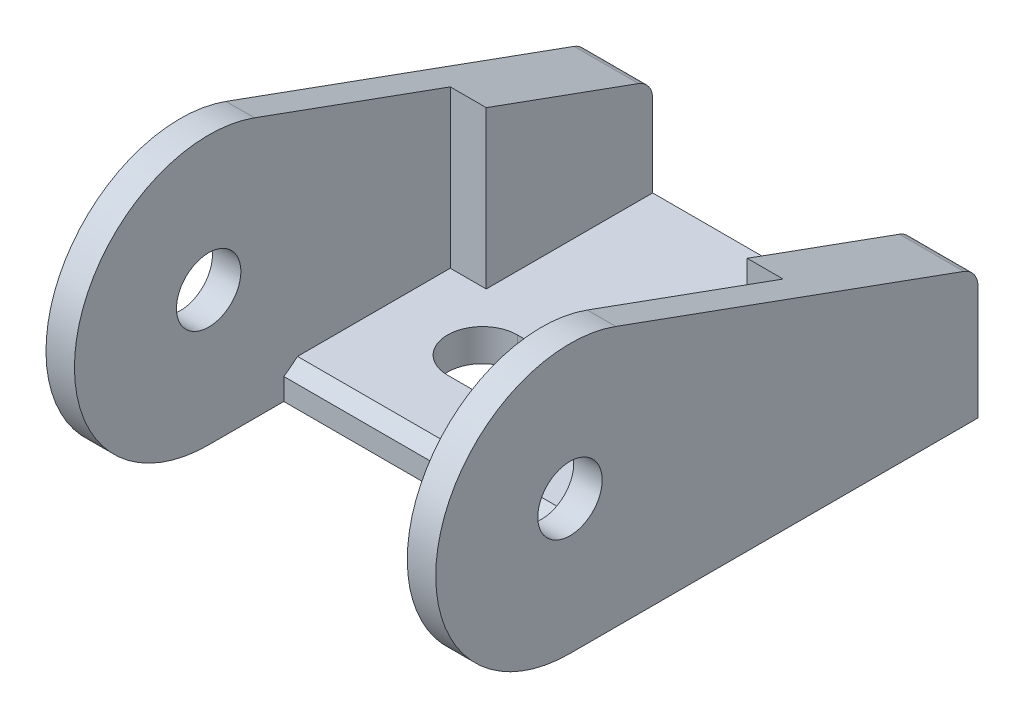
ISO-10303-21;
HEADER;
FILE_DESCRIPTION(('STEP AP214'),'2;1');
FILE_NAME('part.step','',(''),(''),'','','');
FILE_SCHEMA(('AUTOMOTIVE_DESIGN { 1 0 10303 214 1 1 1 1 }'));
ENDSEC;
DATA;
#1=APPLICATION_CONTEXT('core data for automotive mechanical design processes');
#2=APPLICATION_PROTOCOL_DEFINITION('international standard','automotive_design',2000,#1);
#3=PRODUCT_CONTEXT('',#1,'mechanical');
#4=PRODUCT('Part','Part','',(#3));
#5=PRODUCT_RELATED_PRODUCT_CATEGORY('part','',(#4));
#6=PRODUCT_DEFINITION_FORMATION('','',#4);
#7=PRODUCT_DEFINITION_CONTEXT('part definition',#1,'design');
#8=PRODUCT_DEFINITION('design','',#6,#7);
#9=PRODUCT_DEFINITION_SHAPE('','',#8);
#10=(LENGTH_UNIT() NAMED_UNIT(*) SI_UNIT(.MILLI.,.METRE.));
#11=(NAMED_UNIT(*) PLANE_ANGLE_UNIT() SI_UNIT($,.RADIAN.));
#12=(NAMED_UNIT(*) SI_UNIT($,.STERADIAN.) SOLID_ANGLE_UNIT());
#13=UNCERTAINTY_MEASURE_WITH_UNIT(LENGTH_MEASURE(1.E-05),#10,'distance_accuracy_value','');
#14=(GEOMETRIC_REPRESENTATION_CONTEXT(3) GLOBAL_UNCERTAINTY_ASSIGNED_CONTEXT((#13)) GLOBAL_UNIT_ASSIGNED_CONTEXT((#10,
#11,#12)) REPRESENTATION_CONTEXT('',''));
#15=CARTESIAN_POINT('',(0.,0.,0.));
#16=DIRECTION('',(0.,0.,1.));
#17=DIRECTION('',(1.,0.,0.));
#18=AXIS2_PLACEMENT_3D('',#15,#16,#17);
#19=CARTESIAN_POINT('',(12.15,10.5984666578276,-36.));
#20=DIRECTION('',(-1.,0.,0.));
#21=DIRECTION('',(0.,0.,1.));
#22=AXIS2_PLACEMENT_3D('',#19,#20,#21);
#23=CYLINDRICAL_SURFACE('',#22,2.);
#24=CARTESIAN_POINT('',(12.15,10.5984666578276,-36.));
#25=DIRECTION('',(-1.,0.,0.));
#26=DIRECTION('',(0.,0.,1.));
#27=AXIS2_PLACEMENT_3D('',#24,#25,#26);
#28=CIRCLE('',#27,2.);
#29=CARTESIAN_POINT('',(12.15,10.5984666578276,-38.));
#30=VERTEX_POINT('',#29);
#31=CARTESIAN_POINT('',(12.15,12.4783645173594,-36.6826302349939));
#32=VERTEX_POINT('',#31);
#33=EDGE_CURVE('E19',#30,#32,#28,.F.);
#34=ORIENTED_EDGE('',*,*,#33,.T.);
#35=DIRECTION('',(1.,0.,0.));
#36=VECTOR('',#35,1.);
#37=CARTESIAN_POINT('',(12.15,12.4783645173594,-36.6826302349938));
#38=LINE('',#37,#36);
#39=CARTESIAN_POINT('',(18.15,12.4783645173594,-36.6826302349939));
#40=VERTEX_POINT('',#39);
#41=EDGE_CURVE('E210',#40,#32,#38,.F.);
#42=ORIENTED_EDGE('',*,*,#41,.F.);
#43=CARTESIAN_POINT('',(18.15,10.5984666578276,-36.));
#44=DIRECTION('',(-1.,0.,0.));
#45=DIRECTION('',(0.,0.,1.));
#46=AXIS2_PLACEMENT_3D('',#43,#44,#45);
#47=CIRCLE('',#46,2.);
#48=CARTESIAN_POINT('',(18.15,10.5984666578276,-38.));
#49=VERTEX_POINT('',#48);
#50=EDGE_CURVE('E202',#40,#49,#47,.T.);
#51=ORIENTED_EDGE('',*,*,#50,.T.);
#52=DIRECTION('',(1.,0.,0.));
#53=VECTOR('',#52,1.);
#54=CARTESIAN_POINT('',(18.15,10.5984666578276,-38.));
#55=LINE('',#54,#53);
#56=EDGE_CURVE('E195',#49,#30,#55,.F.);
#57=ORIENTED_EDGE('',*,*,#56,.T.);
#58=EDGE_LOOP('',(#34,#42,#51,#57));
#59=FACE_BOUND('',#58,.T.);
#60=ADVANCED_FACE('F16',(#59),#23,.T.);
#61=CARTESIAN_POINT('',(12.15,12.5,0.));
#62=DIRECTION('',(1.,0.,0.));
#63=DIRECTION('',(0.,0.,-1.));
#64=AXIS2_PLACEMENT_3D('',#61,#62,#63);
#65=PLANE('',#64);
#66=DIRECTION('',(0.,0.34131511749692,0.939948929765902));
#67=VECTOR('',#66,1.);
#68=CARTESIAN_POINT('',(12.15,12.4783645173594,-36.6826302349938));
#69=LINE('',#68,#67);
#70=CARTESIAN_POINT('',(12.15,17.6283742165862,-22.5));
#71=VERTEX_POINT('',#70);
#72=EDGE_CURVE('E185',#32,#71,#69,.T.);
#73=ORIENTED_EDGE('',*,*,#72,.F.);
#74=ORIENTED_EDGE('',*,*,#33,.F.);
#75=DIRECTION('',(0.,1.,0.));
#76=VECTOR('',#75,1.);
#77=CARTESIAN_POINT('',(12.15,3.,-38.));
#78=LINE('',#77,#76);
#79=CARTESIAN_POINT('',(12.15,3.,-38.));
#80=VERTEX_POINT('',#79);
#81=EDGE_CURVE('E183',#30,#80,#78,.F.);
#82=ORIENTED_EDGE('',*,*,#81,.T.);
#83=DIRECTION('',(0.,0.,1.));
#84=VECTOR('',#83,1.);
#85=CARTESIAN_POINT('',(12.15,3.,0.));
#86=LINE('',#85,#84);
#87=CARTESIAN_POINT('',(12.15,3.,-22.5));
#88=VERTEX_POINT('',#87);
#89=EDGE_CURVE('E235',#88,#80,#86,.F.);
#90=ORIENTED_EDGE('',*,*,#89,.F.);
#91=DIRECTION('',(0.,1.,0.));
#92=VECTOR('',#91,1.);
#93=CARTESIAN_POINT('',(12.15,3.,-22.5));
#94=LINE('',#93,#92);
#95=EDGE_CURVE('E233',#71,#88,#94,.F.);
#96=ORIENTED_EDGE('',*,*,#95,.F.);
#97=EDGE_LOOP('',(#73,#74,#82,#90,#96));
#98=FACE_BOUND('',#97,.T.);
#99=ADVANCED_FACE('F181',(#98),#65,.F.);
#100=CARTESIAN_POINT('',(-12.15,12.5,0.));
#101=DIRECTION('',(1.,0.,0.));
#102=DIRECTION('',(0.,0.,-1.));
#103=AXIS2_PLACEMENT_3D('',#100,#101,#102);
#104=PLANE('',#103);
#105=DIRECTION('',(0.,1.,0.));
#106=VECTOR('',#105,1.);
#107=CARTESIAN_POINT('',(-12.15,3.,-38.));
#108=LINE('',#107,#106);
#109=CARTESIAN_POINT('',(-12.15,3.,-38.));
#110=VERTEX_POINT('',#109);
#111=CARTESIAN_POINT('',(-12.15,10.5984666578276,-38.));
#112=VERTEX_POINT('',#111);
#113=EDGE_CURVE('E324',#110,#112,#108,.T.);
#114=ORIENTED_EDGE('',*,*,#113,.T.);
#115=CARTESIAN_POINT('',(-12.15,10.5984666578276,-36.));
#116=DIRECTION('',(1.,0.,0.));
#117=DIRECTION('',(0.,0.,-1.));
#118=AXIS2_PLACEMENT_3D('',#115,#116,#117);
#119=CIRCLE('',#118,2.);
#120=CARTESIAN_POINT('',(-12.15,12.4783645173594,-36.6826302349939));
#121=VERTEX_POINT('',#120);
#122=EDGE_CURVE('E189',#121,#112,#119,.F.);
#123=ORIENTED_EDGE('',*,*,#122,.F.);
#124=DIRECTION('',(0.,-0.34131511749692,-0.939948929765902));
#125=VECTOR('',#124,1.);
#126=CARTESIAN_POINT('',(-12.15,12.4783645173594,-36.6826302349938));
#127=LINE('',#126,#125);
#128=CARTESIAN_POINT('',(-12.15,17.6283742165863,-22.5));
#129=VERTEX_POINT('',#128);
#130=EDGE_CURVE('E245',#121,#129,#127,.F.);
#131=ORIENTED_EDGE('',*,*,#130,.T.);
#132=DIRECTION('',(0.,1.,0.));
#133=VECTOR('',#132,1.);
#134=CARTESIAN_POINT('',(-12.15,3.,-22.5));
#135=LINE('',#134,#133);
#136=CARTESIAN_POINT('',(-12.15,3.,-22.5));
#137=VERTEX_POINT('',#136);
#138=EDGE_CURVE('E238',#137,#129,#135,.T.);
#139=ORIENTED_EDGE('',*,*,#138,.F.);
#140=DIRECTION('',(0.,0.,1.));
#141=VECTOR('',#140,1.);
#142=CARTESIAN_POINT('',(-12.15,3.,0.));
#143=LINE('',#142,#141);
#144=EDGE_CURVE('E313',#110,#137,#143,.T.);
#145=ORIENTED_EDGE('',*,*,#144,.F.);
#146=EDGE_LOOP('',(#114,#123,#131,#139,#145));
#147=FACE_BOUND('',#146,.T.);
#148=ADVANCED_FACE('F498',(#147),#104,.T.);
#149=CARTESIAN_POINT('',(-12.15,10.5984666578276,-36.));
#150=DIRECTION('',(1.,0.,0.));
#151=DIRECTION('',(0.,0.,-1.));
#152=AXIS2_PLACEMENT_3D('',#149,#150,#151);
#153=CYLINDRICAL_SURFACE('',#152,2.);
#154=ORIENTED_EDGE('',*,*,#122,.T.);
#155=DIRECTION('',(1.,0.,0.));
#156=VECTOR('',#155,1.);
#157=CARTESIAN_POINT('',(18.15,10.5984666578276,-38.));
#158=LINE('',#157,#156);
#159=CARTESIAN_POINT('',(-18.15,10.5984666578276,-38.));
#160=VERTEX_POINT('',#159);
#161=EDGE_CURVE('E322',#112,#160,#158,.F.);
#162=ORIENTED_EDGE('',*,*,#161,.T.);
#163=CARTESIAN_POINT('',(-18.15,10.5984666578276,-36.));
#164=DIRECTION('',(1.,0.,0.));
#165=DIRECTION('',(0.,0.,-1.));
#166=AXIS2_PLACEMENT_3D('',#163,#164,#165);
#167=CIRCLE('',#166,2.);
#168=CARTESIAN_POINT('',(-18.15,12.4783645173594,-36.6826302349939));
#169=VERTEX_POINT('',#168);
#170=EDGE_CURVE('E290',#160,#169,#167,.T.);
#171=ORIENTED_EDGE('',*,*,#170,.T.);
#172=DIRECTION('',(1.,0.,0.));
#173=VECTOR('',#172,1.);
#174=CARTESIAN_POINT('',(-12.15,12.4783645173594,-36.6826302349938));
#175=LINE('',#174,#173);
#176=EDGE_CURVE('E247',#169,#121,#175,.T.);
#177=ORIENTED_EDGE('',*,*,#176,.T.);
#178=EDGE_LOOP('',(#154,#162,#171,#177));
#179=FACE_BOUND('',#178,.T.);
#180=ADVANCED_FACE('F499',(#179),#153,.T.);
#181=CARTESIAN_POINT('',(-12.15,12.5,0.));
#182=DIRECTION('',(1.,0.,0.));
#183=DIRECTION('',(0.,0.,-1.));
#184=AXIS2_PLACEMENT_3D('',#181,#182,#183);
#185=CYLINDRICAL_SURFACE('',#184,3.);
#186=CARTESIAN_POINT('',(-15.5,12.5,0.));
#187=DIRECTION('',(1.,0.,0.));
#188=DIRECTION('',(0.,0.,-1.));
#189=AXIS2_PLACEMENT_3D('',#186,#187,#188);
#190=CIRCLE('',#189,3.);
#191=CARTESIAN_POINT('',(-15.5,12.5,-3.));
#192=VERTEX_POINT('',#191);
#193=EDGE_CURVE('E280',#192,#192,#190,.F.);
#194=ORIENTED_EDGE('',*,*,#193,.F.);
#195=EDGE_LOOP('',(#194));
#196=FACE_BOUND('',#195,.T.);
#197=CARTESIAN_POINT('',(-18.15,12.5,0.));
#198=DIRECTION('',(1.,0.,0.));
#199=DIRECTION('',(0.,0.,-1.));
#200=AXIS2_PLACEMENT_3D('',#197,#198,#199);
#201=CIRCLE('',#200,3.);
#202=CARTESIAN_POINT('',(-18.15,12.5,-3.));
#203=VERTEX_POINT('',#202);
#204=EDGE_CURVE('E286',#203,#203,#201,.F.);
#205=ORIENTED_EDGE('',*,*,#204,.T.);
#206=EDGE_LOOP('',(#205));
#207=FACE_BOUND('',#206,.T.);
#208=ADVANCED_FACE('F501',(#196,#207),#185,.F.);
#209=CARTESIAN_POINT('',(-12.15,12.4783645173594,-36.6826302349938));
#210=DIRECTION('',(0.,-0.939948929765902,0.34131511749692));
#211=DIRECTION('',(0.,-0.34131511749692,-0.939948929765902));
#212=AXIS2_PLACEMENT_3D('',#209,#210,#211);
#213=PLANE('',#212);
#214=ORIENTED_EDGE('',*,*,#130,.F.);
#215=ORIENTED_EDGE('',*,*,#176,.F.);
#216=DIRECTION('',(0.,0.341315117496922,0.939948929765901));
#217=VECTOR('',#216,1.);
#218=CARTESIAN_POINT('',(-18.15,12.4783645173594,-36.6826302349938));
#219=LINE('',#218,#217);
#220=CARTESIAN_POINT('',(-18.15,24.2493616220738,-4.26643896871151));
#221=VERTEX_POINT('',#220);
#222=EDGE_CURVE('E289',#169,#221,#219,.T.);
#223=ORIENTED_EDGE('',*,*,#222,.T.);
#224=DIRECTION('',(1.,0.,0.));
#225=VECTOR('',#224,1.);
#226=CARTESIAN_POINT('',(-12.15,24.2493616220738,-4.26643896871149));
#227=LINE('',#226,#225);
#228=CARTESIAN_POINT('',(-15.5,24.2493616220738,-4.2664389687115));
#229=VERTEX_POINT('',#228);
#230=EDGE_CURVE('E285',#229,#221,#227,.F.);
#231=ORIENTED_EDGE('',*,*,#230,.F.);
#232=DIRECTION('',(0.,0.34131511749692,0.939948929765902));
#233=VECTOR('',#232,1.);
#234=CARTESIAN_POINT('',(-15.5,17.6283742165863,-22.5));
#235=LINE('',#234,#233);
#236=CARTESIAN_POINT('',(-15.5,17.6283742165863,-22.5));
#237=VERTEX_POINT('',#236);
#238=EDGE_CURVE('E279',#237,#229,#235,.T.);
#239=ORIENTED_EDGE('',*,*,#238,.F.);
#240=DIRECTION('',(1.,0.,0.));
#241=VECTOR('',#240,1.);
#242=CARTESIAN_POINT('',(15.5,17.6283742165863,-22.5));
#243=LINE('',#242,#241);
#244=EDGE_CURVE('E242',#129,#237,#243,.F.);
#245=ORIENTED_EDGE('',*,*,#244,.F.);
#246=EDGE_LOOP('',(#214,#215,#223,#231,#239,#245));
#247=FACE_BOUND('',#246,.T.);
#248=ADVANCED_FACE('F378',(#247),#213,.F.);
#249=CARTESIAN_POINT('',(15.5,3.,-22.5));
#250=DIRECTION('',(0.,0.,1.));
#251=DIRECTION('',(1.,0.,0.));
#252=AXIS2_PLACEMENT_3D('',#249,#250,#251);
#253=PLANE('',#252);
#254=DIRECTION('',(1.,0.,0.));
#255=VECTOR('',#254,1.);
#256=CARTESIAN_POINT('',(0.,3.,-22.5));
#257=LINE('',#256,#255);
#258=CARTESIAN_POINT('',(-15.5,3.,-22.5));
#259=VERTEX_POINT('',#258);
#260=EDGE_CURVE('E333',#137,#259,#257,.F.);
#261=ORIENTED_EDGE('',*,*,#260,.F.);
#262=ORIENTED_EDGE('',*,*,#138,.T.);
#263=ORIENTED_EDGE('',*,*,#244,.T.);
#264=DIRECTION('',(0.,1.,0.));
#265=VECTOR('',#264,1.);
#266=CARTESIAN_POINT('',(-15.5,12.5,-22.5));
#267=LINE('',#266,#265);
#268=EDGE_CURVE('E359',#259,#237,#267,.T.);
#269=ORIENTED_EDGE('',*,*,#268,.F.);
#270=EDGE_LOOP('',(#261,#262,#263,#269));
#271=FACE_BOUND('',#270,.T.);
#272=ADVANCED_FACE('F368',(#271),#253,.T.);
#273=CARTESIAN_POINT('',(15.5,12.5000000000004,3.0964814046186E-13));
#274=DIRECTION('',(1.,0.,0.));
#275=DIRECTION('',(0.,0.,-1.));
#276=AXIS2_PLACEMENT_3D('',#273,#274,#275);
#277=CYLINDRICAL_SURFACE('',#276,12.6000000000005);
#278=DIRECTION('',(-1.,0.,0.));
#279=VECTOR('',#278,1.);
#280=CARTESIAN_POINT('',(-18.15,2.02335931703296,-7.));
#281=LINE('',#280,#279);
#282=CARTESIAN_POINT('',(-15.5,2.02335931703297,-7.));
#283=VERTEX_POINT('',#282);
#284=CARTESIAN_POINT('',(15.5,2.02335931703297,-7.));
#285=VERTEX_POINT('',#284);
#286=EDGE_CURVE('E273',#283,#285,#281,.F.);
#287=ORIENTED_EDGE('',*,*,#286,.T.);
#288=CARTESIAN_POINT('',(15.5,12.5000000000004,3.0964814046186E-13));
#289=DIRECTION('',(1.,0.,0.));
#290=DIRECTION('',(0.,0.,-1.));
#291=AXIS2_PLACEMENT_3D('',#288,#289,#290);
#292=CIRCLE('',#291,12.6000000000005);
#293=CARTESIAN_POINT('',(15.5,3.,-8.2770767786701));
#294=VERTEX_POINT('',#293);
#295=EDGE_CURVE('E241',#294,#285,#292,.F.);
#296=ORIENTED_EDGE('',*,*,#295,.F.);
#297=DIRECTION('',(1.,0.,0.));
#298=VECTOR('',#297,1.);
#299=CARTESIAN_POINT('',(0.,3.,-8.2770767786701));
#300=LINE('',#299,#298);
#301=CARTESIAN_POINT('',(-15.5,3.,-8.2770767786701));
#302=VERTEX_POINT('',#301);
#303=EDGE_CURVE('E337',#302,#294,#300,.T.);
#304=ORIENTED_EDGE('',*,*,#303,.F.);
#305=CARTESIAN_POINT('',(-15.5,12.5000000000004,3.0964814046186E-13));
#306=DIRECTION('',(1.,0.,0.));
#307=DIRECTION('',(0.,0.,-1.));
#308=AXIS2_PLACEMENT_3D('',#305,#306,#307);
#309=CIRCLE('',#308,12.6000000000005);
#310=EDGE_CURVE('E274',#283,#302,#309,.T.);
#311=ORIENTED_EDGE('',*,*,#310,.F.);
#312=EDGE_LOOP('',(#287,#296,#304,#311));
#313=FACE_BOUND('',#312,.T.);
#314=ADVANCED_FACE('F496',(#313),#277,.F.);
#315=CARTESIAN_POINT('',(0.,3.,0.));
#316=DIRECTION('',(0.,1.,0.));
#317=DIRECTION('',(0.,0.,1.));
#318=AXIS2_PLACEMENT_3D('',#315,#316,#317);
#319=PLANE('',#318);
#320=DIRECTION('',(-1.,0.,0.));
#321=VECTOR('',#320,1.);
#322=CARTESIAN_POINT('',(-7.,3.,-13.75));
#323=LINE('',#322,#321);
#324=CARTESIAN_POINT('',(-7.,3.,-13.75));
#325=VERTEX_POINT('',#324);
#326=CARTESIAN_POINT('',(-3.,3.,-13.75));
#327=VERTEX_POINT('',#326);
#328=EDGE_CURVE('E218',#325,#327,#323,.F.);
#329=ORIENTED_EDGE('',*,*,#328,.F.);
#330=CARTESIAN_POINT('',(-7.,3.,-17.));
#331=DIRECTION('',(0.,1.,0.));
#332=DIRECTION('',(0.,0.,1.));
#333=AXIS2_PLACEMENT_3D('',#330,#331,#332);
#334=CIRCLE('',#333,3.25);
#335=CARTESIAN_POINT('',(-7.,3.,-20.25));
#336=VERTEX_POINT('',#335);
#337=EDGE_CURVE('E301',#325,#336,#334,.F.);
#338=ORIENTED_EDGE('',*,*,#337,.T.);
#339=DIRECTION('',(1.,0.,0.));
#340=VECTOR('',#339,1.);
#341=CARTESIAN_POINT('',(-3.,3.,-20.25));
#342=LINE('',#341,#340);
#343=CARTESIAN_POINT('',(-3.,3.,-20.25));
#344=VERTEX_POINT('',#343);
#345=EDGE_CURVE('E214',#344,#336,#342,.F.);
#346=ORIENTED_EDGE('',*,*,#345,.F.);
#347=CARTESIAN_POINT('',(-3.,3.,-17.));
#348=DIRECTION('',(0.,1.,0.));
#349=DIRECTION('',(0.,0.,1.));
#350=AXIS2_PLACEMENT_3D('',#347,#348,#349);
#351=CIRCLE('',#350,3.25);
#352=EDGE_CURVE('E221',#344,#327,#351,.F.);
#353=ORIENTED_EDGE('',*,*,#352,.T.);
#354=EDGE_LOOP('',(#329,#338,#346,#353));
#355=FACE_BOUND('',#354,.T.);
#356=ORIENTED_EDGE('',*,*,#89,.T.);
#357=DIRECTION('',(1.,0.,0.));
#358=VECTOR('',#357,1.);
#359=CARTESIAN_POINT('',(18.15,3.,-38.));
#360=LINE('',#359,#358);
#361=EDGE_CURVE('E199',#80,#110,#360,.F.);
#362=ORIENTED_EDGE('',*,*,#361,.T.);
#363=ORIENTED_EDGE('',*,*,#144,.T.);
#364=ORIENTED_EDGE('',*,*,#260,.T.);
#365=DIRECTION('',(0.,0.,-1.));
#366=VECTOR('',#365,1.);
#367=CARTESIAN_POINT('',(-15.5,3.,0.));
#368=LINE('',#367,#366);
#369=EDGE_CURVE('E276',#302,#259,#368,.T.);
#370=ORIENTED_EDGE('',*,*,#369,.F.);
#371=ORIENTED_EDGE('',*,*,#303,.T.);
#372=DIRECTION('',(0.,0.,-1.));
#373=VECTOR('',#372,1.);
#374=CARTESIAN_POINT('',(15.5,3.,0.));
#375=LINE('',#374,#373);
#376=CARTESIAN_POINT('',(15.5,3.,-22.5));
#377=VERTEX_POINT('',#376);
#378=EDGE_CURVE('E434',#294,#377,#375,.T.);
#379=ORIENTED_EDGE('',*,*,#378,.T.);
#380=DIRECTION('',(1.,0.,0.));
#381=VECTOR('',#380,1.);
#382=CARTESIAN_POINT('',(15.5,3.,-22.5));
#383=LINE('',#382,#381);
#384=EDGE_CURVE('E230',#88,#377,#383,.T.);
#385=ORIENTED_EDGE('',*,*,#384,.F.);
#386=EDGE_LOOP('',(#356,#362,#363,#364,#370,#371,#379,#385));
#387=FACE_BOUND('',#386,.T.);
#388=DIRECTION('',(-1.,0.,0.));
#389=VECTOR('',#388,1.);
#390=CARTESIAN_POINT('',(3.,3.,-27.75));
#391=LINE('',#390,#389);
#392=CARTESIAN_POINT('',(3.,3.,-27.75));
#393=VERTEX_POINT('',#392);
#394=CARTESIAN_POINT('',(7.,3.,-27.75));
#395=VERTEX_POINT('',#394);
#396=EDGE_CURVE('E226',#393,#395,#391,.F.);
#397=ORIENTED_EDGE('',*,*,#396,.F.);
#398=CARTESIAN_POINT('',(3.,3.,-31.));
#399=DIRECTION('',(0.,1.,0.));
#400=DIRECTION('',(0.,0.,1.));
#401=AXIS2_PLACEMENT_3D('',#398,#399,#400);
#402=CIRCLE('',#401,3.25);
#403=CARTESIAN_POINT('',(3.,3.,-34.25));
#404=VERTEX_POINT('',#403);
#405=EDGE_CURVE('E307',#393,#404,#402,.F.);
#406=ORIENTED_EDGE('',*,*,#405,.T.);
#407=DIRECTION('',(1.,0.,0.));
#408=VECTOR('',#407,1.);
#409=CARTESIAN_POINT('',(7.,3.,-34.25));
#410=LINE('',#409,#408);
#411=CARTESIAN_POINT('',(7.,3.,-34.25));
#412=VERTEX_POINT('',#411);
#413=EDGE_CURVE('E222',#412,#404,#410,.F.);
#414=ORIENTED_EDGE('',*,*,#413,.F.);
#415=CARTESIAN_POINT('',(7.,3.,-31.));
#416=DIRECTION('',(0.,1.,0.));
#417=DIRECTION('',(0.,0.,1.));
#418=AXIS2_PLACEMENT_3D('',#415,#416,#417);
#419=CIRCLE('',#418,3.25);
#420=EDGE_CURVE('E212',#412,#395,#419,.F.);
#421=ORIENTED_EDGE('',*,*,#420,.T.);
#422=EDGE_LOOP('',(#397,#406,#414,#421));
#423=FACE_BOUND('',#422,.T.);
#424=ADVANCED_FACE('F444',(#355,#387,#423),#319,.T.);
#425=CARTESIAN_POINT('',(15.5,3.,-22.5));
#426=DIRECTION('',(0.,0.,1.));
#427=DIRECTION('',(1.,0.,0.));
#428=AXIS2_PLACEMENT_3D('',#425,#426,#427);
#429=PLANE('',#428);
#430=DIRECTION('',(0.,1.,0.));
#431=VECTOR('',#430,1.);
#432=CARTESIAN_POINT('',(15.5,12.5,-22.5));
#433=LINE('',#432,#431);
#434=CARTESIAN_POINT('',(15.5,17.6283742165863,-22.5));
#435=VERTEX_POINT('',#434);
#436=EDGE_CURVE('E431',#377,#435,#433,.T.);
#437=ORIENTED_EDGE('',*,*,#436,.T.);
#438=DIRECTION('',(1.,0.,0.));
#439=VECTOR('',#438,1.);
#440=CARTESIAN_POINT('',(12.15,17.6283742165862,-22.5));
#441=LINE('',#440,#439);
#442=EDGE_CURVE('E213',#71,#435,#441,.T.);
#443=ORIENTED_EDGE('',*,*,#442,.F.);
#444=ORIENTED_EDGE('',*,*,#95,.T.);
#445=ORIENTED_EDGE('',*,*,#384,.T.);
#446=EDGE_LOOP('',(#437,#443,#444,#445));
#447=FACE_BOUND('',#446,.T.);
#448=ADVANCED_FACE('F438',(#447),#429,.T.);
#449=CARTESIAN_POINT('',(12.15,12.4783645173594,-36.6826302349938));
#450=DIRECTION('',(0.,0.939948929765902,-0.34131511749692));
#451=DIRECTION('',(0.,0.34131511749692,0.939948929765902));
#452=AXIS2_PLACEMENT_3D('',#449,#450,#451);
#453=PLANE('',#452);
#454=DIRECTION('',(0.,-0.341315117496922,-0.939948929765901));
#455=VECTOR('',#454,1.);
#456=CARTESIAN_POINT('',(18.15,24.2493616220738,-4.2664389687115));
#457=LINE('',#456,#455);
#458=CARTESIAN_POINT('',(18.15,24.2493616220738,-4.26643896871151));
#459=VERTEX_POINT('',#458);
#460=EDGE_CURVE('E300',#459,#40,#457,.T.);
#461=ORIENTED_EDGE('',*,*,#460,.T.);
#462=ORIENTED_EDGE('',*,*,#41,.T.);
#463=ORIENTED_EDGE('',*,*,#72,.T.);
#464=ORIENTED_EDGE('',*,*,#442,.T.);
#465=DIRECTION('',(0.,0.34131511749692,0.939948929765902));
#466=VECTOR('',#465,1.);
#467=CARTESIAN_POINT('',(15.5,17.6283742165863,-22.5));
#468=LINE('',#467,#466);
#469=CARTESIAN_POINT('',(15.5,24.2493616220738,-4.2664389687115));
#470=VERTEX_POINT('',#469);
#471=EDGE_CURVE('E269',#435,#470,#468,.T.);
#472=ORIENTED_EDGE('',*,*,#471,.T.);
#473=DIRECTION('',(-1.,0.,0.));
#474=VECTOR('',#473,1.);
#475=CARTESIAN_POINT('',(12.15,24.2493616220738,-4.26643896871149));
#476=LINE('',#475,#474);
#477=EDGE_CURVE('E355',#459,#470,#476,.T.);
#478=ORIENTED_EDGE('',*,*,#477,.F.);
#479=EDGE_LOOP('',(#461,#462,#463,#464,#472,#478));
#480=FACE_BOUND('',#479,.T.);
#481=ADVANCED_FACE('F572',(#480),#453,.T.);
#482=CARTESIAN_POINT('',(12.15,12.5,0.));
#483=DIRECTION('',(-1.,0.,0.));
#484=DIRECTION('',(0.,0.,1.));
#485=AXIS2_PLACEMENT_3D('',#482,#483,#484);
#486=CYLINDRICAL_SURFACE('',#485,3.);
#487=CARTESIAN_POINT('',(18.15,12.5,0.));
#488=DIRECTION('',(-1.,0.,0.));
#489=DIRECTION('',(0.,0.,1.));
#490=AXIS2_PLACEMENT_3D('',#487,#488,#489);
#491=CIRCLE('',#490,3.);
#492=CARTESIAN_POINT('',(18.15,12.5,3.));
#493=VERTEX_POINT('',#492);
#494=EDGE_CURVE('E205',#493,#493,#491,.F.);
#495=ORIENTED_EDGE('',*,*,#494,.T.);
#496=EDGE_LOOP('',(#495));
#497=FACE_BOUND('',#496,.T.);
#498=CARTESIAN_POINT('',(15.5,12.5,0.));
#499=DIRECTION('',(-1.,0.,0.));
#500=DIRECTION('',(0.,0.,1.));
#501=AXIS2_PLACEMENT_3D('',#498,#499,#500);
#502=CIRCLE('',#501,3.);
#503=CARTESIAN_POINT('',(15.5,12.5,3.));
#504=VERTEX_POINT('',#503);
#505=EDGE_CURVE('E266',#504,#504,#502,.T.);
#506=ORIENTED_EDGE('',*,*,#505,.T.);
#507=EDGE_LOOP('',(#506));
#508=FACE_BOUND('',#507,.T.);
#509=ADVANCED_FACE('F568',(#497,#508),#486,.F.);
#510=CARTESIAN_POINT('',(7.,3.,-31.));
#511=DIRECTION('',(0.,1.,0.));
#512=DIRECTION('',(0.,0.,1.));
#513=AXIS2_PLACEMENT_3D('',#510,#511,#512);
#514=CYLINDRICAL_SURFACE('',#513,3.25);
#515=DIRECTION('',(0.,1.,0.));
#516=VECTOR('',#515,1.);
#517=CARTESIAN_POINT('',(7.,3.,-27.75));
#518=LINE('',#517,#516);
#519=CARTESIAN_POINT('',(7.,0.,-27.75));
#520=VERTEX_POINT('',#519);
#521=EDGE_CURVE('E228',#395,#520,#518,.F.);
#522=ORIENTED_EDGE('',*,*,#521,.F.);
#523=ORIENTED_EDGE('',*,*,#420,.F.);
#524=DIRECTION('',(0.,1.,0.));
#525=VECTOR('',#524,1.);
#526=CARTESIAN_POINT('',(7.,3.,-34.25));
#527=LINE('',#526,#525);
#528=CARTESIAN_POINT('',(7.,0.,-34.25));
#529=VERTEX_POINT('',#528);
#530=EDGE_CURVE('E225',#529,#412,#527,.T.);
#531=ORIENTED_EDGE('',*,*,#530,.F.);
#532=CARTESIAN_POINT('',(7.,0.,-31.));
#533=DIRECTION('',(0.,1.,0.));
#534=DIRECTION('',(0.,0.,1.));
#535=AXIS2_PLACEMENT_3D('',#532,#533,#534);
#536=CIRCLE('',#535,3.25);
#537=EDGE_CURVE('E263',#529,#520,#536,.F.);
#538=ORIENTED_EDGE('',*,*,#537,.T.);
#539=EDGE_LOOP('',(#522,#523,#531,#538));
#540=FACE_BOUND('',#539,.T.);
#541=ADVANCED_FACE('F564',(#540),#514,.F.);
#542=CARTESIAN_POINT('',(3.,3.,-27.75));
#543=DIRECTION('',(0.,0.,-1.));
#544=DIRECTION('',(-1.,0.,0.));
#545=AXIS2_PLACEMENT_3D('',#542,#543,#544);
#546=PLANE('',#545);
#547=ORIENTED_EDGE('',*,*,#396,.T.);
#548=ORIENTED_EDGE('',*,*,#521,.T.);
#549=DIRECTION('',(1.,0.,0.));
#550=VECTOR('',#549,1.);
#551=CARTESIAN_POINT('',(0.,0.,-27.75));
#552=LINE('',#551,#550);
#553=CARTESIAN_POINT('',(3.,0.,-27.75));
#554=VERTEX_POINT('',#553);
#555=EDGE_CURVE('E262',#520,#554,#552,.F.);
#556=ORIENTED_EDGE('',*,*,#555,.T.);
#557=DIRECTION('',(0.,1.,0.));
#558=VECTOR('',#557,1.);
#559=CARTESIAN_POINT('',(3.,3.,-27.75));
#560=LINE('',#559,#558);
#561=EDGE_CURVE('E310',#554,#393,#560,.T.);
#562=ORIENTED_EDGE('',*,*,#561,.T.);
#563=EDGE_LOOP('',(#547,#548,#556,#562));
#564=FACE_BOUND('',#563,.T.);
#565=ADVANCED_FACE('F560',(#564),#546,.T.);
#566=CARTESIAN_POINT('',(3.,3.,-31.));
#567=DIRECTION('',(0.,1.,0.));
#568=DIRECTION('',(0.,0.,1.));
#569=AXIS2_PLACEMENT_3D('',#566,#567,#568);
#570=CYLINDRICAL_SURFACE('',#569,3.25);
#571=DIRECTION('',(0.,1.,0.));
#572=VECTOR('',#571,1.);
#573=CARTESIAN_POINT('',(3.,3.,-34.25));
#574=LINE('',#573,#572);
#575=CARTESIAN_POINT('',(3.,0.,-34.25));
#576=VERTEX_POINT('',#575);
#577=EDGE_CURVE('E224',#404,#576,#574,.F.);
#578=ORIENTED_EDGE('',*,*,#577,.F.);
#579=ORIENTED_EDGE('',*,*,#405,.F.);
#580=ORIENTED_EDGE('',*,*,#561,.F.);
#581=CARTESIAN_POINT('',(3.,0.,-31.));
#582=DIRECTION('',(0.,1.,0.));
#583=DIRECTION('',(0.,0.,1.));
#584=AXIS2_PLACEMENT_3D('',#581,#582,#583);
#585=CIRCLE('',#584,3.25);
#586=EDGE_CURVE('E259',#554,#576,#585,.F.);
#587=ORIENTED_EDGE('',*,*,#586,.T.);
#588=EDGE_LOOP('',(#578,#579,#580,#587));
#589=FACE_BOUND('',#588,.T.);
#590=ADVANCED_FACE('F556',(#589),#570,.F.);
#591=CARTESIAN_POINT('',(7.,3.,-34.25));
#592=DIRECTION('',(0.,0.,1.));
#593=DIRECTION('',(1.,0.,0.));
#594=AXIS2_PLACEMENT_3D('',#591,#592,#593);
#595=PLANE('',#594);
#596=ORIENTED_EDGE('',*,*,#413,.T.);
#597=ORIENTED_EDGE('',*,*,#577,.T.);
#598=DIRECTION('',(1.,0.,0.));
#599=VECTOR('',#598,1.);
#600=CARTESIAN_POINT('',(0.,0.,-34.25));
#601=LINE('',#600,#599);
#602=EDGE_CURVE('E258',#576,#529,#601,.T.);
#603=ORIENTED_EDGE('',*,*,#602,.T.);
#604=ORIENTED_EDGE('',*,*,#530,.T.);
#605=EDGE_LOOP('',(#596,#597,#603,#604));
#606=FACE_BOUND('',#605,.T.);
#607=ADVANCED_FACE('F552',(#606),#595,.T.);
#608=CARTESIAN_POINT('',(-3.,3.,-17.));
#609=DIRECTION('',(0.,1.,0.));
#610=DIRECTION('',(0.,0.,1.));
#611=AXIS2_PLACEMENT_3D('',#608,#609,#610);
#612=CYLINDRICAL_SURFACE('',#611,3.25);
#613=DIRECTION('',(0.,1.,0.));
#614=VECTOR('',#613,1.);
#615=CARTESIAN_POINT('',(-3.,3.,-13.75));
#616=LINE('',#615,#614);
#617=CARTESIAN_POINT('',(-3.,0.,-13.75));
#618=VERTEX_POINT('',#617);
#619=EDGE_CURVE('E220',#327,#618,#616,.F.);
#620=ORIENTED_EDGE('',*,*,#619,.F.);
#621=ORIENTED_EDGE('',*,*,#352,.F.);
#622=DIRECTION('',(0.,1.,0.));
#623=VECTOR('',#622,1.);
#624=CARTESIAN_POINT('',(-3.,3.,-20.25));
#625=LINE('',#624,#623);
#626=CARTESIAN_POINT('',(-3.,0.,-20.25));
#627=VERTEX_POINT('',#626);
#628=EDGE_CURVE('E217',#627,#344,#625,.T.);
#629=ORIENTED_EDGE('',*,*,#628,.F.);
#630=CARTESIAN_POINT('',(-3.,0.,-17.));
#631=DIRECTION('',(0.,1.,0.));
#632=DIRECTION('',(0.,0.,1.));
#633=AXIS2_PLACEMENT_3D('',#630,#631,#632);
#634=CIRCLE('',#633,3.25);
#635=EDGE_CURVE('E255',#627,#618,#634,.F.);
#636=ORIENTED_EDGE('',*,*,#635,.T.);
#637=EDGE_LOOP('',(#620,#621,#629,#636));
#638=FACE_BOUND('',#637,.T.);
#639=ADVANCED_FACE('F548',(#638),#612,.F.);
#640=CARTESIAN_POINT('',(-7.,3.,-13.75));
#641=DIRECTION('',(0.,0.,-1.));
#642=DIRECTION('',(-1.,0.,0.));
#643=AXIS2_PLACEMENT_3D('',#640,#641,#642);
#644=PLANE('',#643);
#645=ORIENTED_EDGE('',*,*,#328,.T.);
#646=ORIENTED_EDGE('',*,*,#619,.T.);
#647=DIRECTION('',(1.,0.,0.));
#648=VECTOR('',#647,1.);
#649=CARTESIAN_POINT('',(0.,0.,-13.75));
#650=LINE('',#649,#648);
#651=CARTESIAN_POINT('',(-7.,0.,-13.75));
#652=VERTEX_POINT('',#651);
#653=EDGE_CURVE('E254',#618,#652,#650,.F.);
#654=ORIENTED_EDGE('',*,*,#653,.T.);
#655=DIRECTION('',(0.,1.,0.));
#656=VECTOR('',#655,1.);
#657=CARTESIAN_POINT('',(-7.,3.,-13.75));
#658=LINE('',#657,#656);
#659=EDGE_CURVE('E304',#652,#325,#658,.T.);
#660=ORIENTED_EDGE('',*,*,#659,.T.);
#661=EDGE_LOOP('',(#645,#646,#654,#660));
#662=FACE_BOUND('',#661,.T.);
#663=ADVANCED_FACE('F544',(#662),#644,.T.);
#664=CARTESIAN_POINT('',(-7.,3.,-17.));
#665=DIRECTION('',(0.,1.,0.));
#666=DIRECTION('',(0.,0.,1.));
#667=AXIS2_PLACEMENT_3D('',#664,#665,#666);
#668=CYLINDRICAL_SURFACE('',#667,3.25);
#669=DIRECTION('',(0.,1.,0.));
#670=VECTOR('',#669,1.);
#671=CARTESIAN_POINT('',(-7.,3.,-20.25));
#672=LINE('',#671,#670);
#673=CARTESIAN_POINT('',(-7.,0.,-20.25));
#674=VERTEX_POINT('',#673);
#675=EDGE_CURVE('E216',#336,#674,#672,.F.);
#676=ORIENTED_EDGE('',*,*,#675,.F.);
#677=ORIENTED_EDGE('',*,*,#337,.F.);
#678=ORIENTED_EDGE('',*,*,#659,.F.);
#679=CARTESIAN_POINT('',(-7.,0.,-17.));
#680=DIRECTION('',(0.,1.,0.));
#681=DIRECTION('',(0.,0.,1.));
#682=AXIS2_PLACEMENT_3D('',#679,#680,#681);
#683=CIRCLE('',#682,3.25);
#684=EDGE_CURVE('E250',#652,#674,#683,.F.);
#685=ORIENTED_EDGE('',*,*,#684,.T.);
#686=EDGE_LOOP('',(#676,#677,#678,#685));
#687=FACE_BOUND('',#686,.T.);
#688=ADVANCED_FACE('F540',(#687),#668,.F.);
#689=CARTESIAN_POINT('',(-3.,3.,-20.25));
#690=DIRECTION('',(0.,0.,1.));
#691=DIRECTION('',(1.,0.,0.));
#692=AXIS2_PLACEMENT_3D('',#689,#690,#691);
#693=PLANE('',#692);
#694=ORIENTED_EDGE('',*,*,#345,.T.);
#695=ORIENTED_EDGE('',*,*,#675,.T.);
#696=DIRECTION('',(1.,0.,0.));
#697=VECTOR('',#696,1.);
#698=CARTESIAN_POINT('',(0.,0.,-20.25));
#699=LINE('',#698,#697);
#700=EDGE_CURVE('E253',#674,#627,#699,.T.);
#701=ORIENTED_EDGE('',*,*,#700,.T.);
#702=ORIENTED_EDGE('',*,*,#628,.T.);
#703=EDGE_LOOP('',(#694,#695,#701,#702));
#704=FACE_BOUND('',#703,.T.);
#705=ADVANCED_FACE('F537',(#704),#693,.T.);
#706=CARTESIAN_POINT('',(12.15,12.5,0.));
#707=DIRECTION('',(-1.,0.,0.));
#708=DIRECTION('',(0.,0.,1.));
#709=AXIS2_PLACEMENT_3D('',#706,#707,#708);
#710=CYLINDRICAL_SURFACE('',#709,12.5);
#711=CARTESIAN_POINT('',(18.15,12.5,0.));
#712=DIRECTION('',(-1.,0.,0.));
#713=DIRECTION('',(0.,0.,1.));
#714=AXIS2_PLACEMENT_3D('',#711,#712,#713);
#715=CIRCLE('',#714,12.5);
#716=CARTESIAN_POINT('',(18.15,0.,0.));
#717=VERTEX_POINT('',#716);
#718=EDGE_CURVE('E296',#717,#459,#715,.T.);
#719=ORIENTED_EDGE('',*,*,#718,.T.);
#720=ORIENTED_EDGE('',*,*,#477,.T.);
#721=CARTESIAN_POINT('',(15.5,12.5,0.));
#722=DIRECTION('',(-1.,0.,0.));
#723=DIRECTION('',(0.,0.,1.));
#724=AXIS2_PLACEMENT_3D('',#721,#722,#723);
#725=CIRCLE('',#724,12.5);
#726=CARTESIAN_POINT('',(15.5,0.,0.));
#727=VERTEX_POINT('',#726);
#728=EDGE_CURVE('E270',#470,#727,#725,.F.);
#729=ORIENTED_EDGE('',*,*,#728,.T.);
#730=DIRECTION('',(1.,0.,0.));
#731=VECTOR('',#730,1.);
#732=CARTESIAN_POINT('',(0.,0.,0.));
#733=LINE('',#732,#731);
#734=EDGE_CURVE('E411',#727,#717,#733,.T.);
#735=ORIENTED_EDGE('',*,*,#734,.T.);
#736=EDGE_LOOP('',(#719,#720,#729,#735));
#737=FACE_BOUND('',#736,.T.);
#738=ADVANCED_FACE('F490',(#737),#710,.T.);
#739=CARTESIAN_POINT('',(18.15,3.,-7.));
#740=DIRECTION('',(-1.,0.,0.));
#741=DIRECTION('',(0.,0.,1.));
#742=AXIS2_PLACEMENT_3D('',#739,#740,#741);
#743=PLANE('',#742);
#744=ORIENTED_EDGE('',*,*,#494,.F.);
#745=EDGE_LOOP('',(#744));
#746=FACE_BOUND('',#745,.T.);
#747=DIRECTION('',(0.,0.,1.));
#748=VECTOR('',#747,1.);
#749=CARTESIAN_POINT('',(18.15,0.,0.));
#750=LINE('',#749,#748);
#751=CARTESIAN_POINT('',(18.15,0.,-38.));
#752=VERTEX_POINT('',#751);
#753=EDGE_CURVE('E404',#717,#752,#750,.F.);
#754=ORIENTED_EDGE('',*,*,#753,.T.);
#755=DIRECTION('',(0.,1.,0.));
#756=VECTOR('',#755,1.);
#757=CARTESIAN_POINT('',(18.15,3.,-38.));
#758=LINE('',#757,#756);
#759=EDGE_CURVE('E203',#752,#49,#758,.T.);
#760=ORIENTED_EDGE('',*,*,#759,.T.);
#761=ORIENTED_EDGE('',*,*,#50,.F.);
#762=ORIENTED_EDGE('',*,*,#460,.F.);
#763=ORIENTED_EDGE('',*,*,#718,.F.);
#764=EDGE_LOOP('',(#754,#760,#761,#762,#763));
#765=FACE_BOUND('',#764,.T.);
#766=ADVANCED_FACE('F488',(#746,#765),#743,.F.);
#767=CARTESIAN_POINT('',(18.15,3.,-38.));
#768=DIRECTION('',(0.,0.,1.));
#769=DIRECTION('',(1.,0.,0.));
#770=AXIS2_PLACEMENT_3D('',#767,#768,#769);
#771=PLANE('',#770);
#772=DIRECTION('',(0.,1.,0.));
#773=VECTOR('',#772,1.);
#774=CARTESIAN_POINT('',(-18.15,3.,-38.));
#775=LINE('',#774,#773);
#776=CARTESIAN_POINT('',(-18.15,0.,-38.));
#777=VERTEX_POINT('',#776);
#778=EDGE_CURVE('E293',#777,#160,#775,.T.);
#779=ORIENTED_EDGE('',*,*,#778,.T.);
#780=ORIENTED_EDGE('',*,*,#161,.F.);
#781=ORIENTED_EDGE('',*,*,#113,.F.);
#782=ORIENTED_EDGE('',*,*,#361,.F.);
#783=ORIENTED_EDGE('',*,*,#81,.F.);
#784=ORIENTED_EDGE('',*,*,#56,.F.);
#785=ORIENTED_EDGE('',*,*,#759,.F.);
#786=DIRECTION('',(1.,0.,0.));
#787=VECTOR('',#786,1.);
#788=CARTESIAN_POINT('',(0.,0.,-38.));
#789=LINE('',#788,#787);
#790=EDGE_CURVE('E395',#752,#777,#789,.F.);
#791=ORIENTED_EDGE('',*,*,#790,.T.);
#792=EDGE_LOOP('',(#779,#780,#781,#782,#783,#784,#785,#791));
#793=FACE_BOUND('',#792,.T.);
#794=ADVANCED_FACE('F194',(#793),#771,.F.);
#795=CARTESIAN_POINT('',(-18.15,3.,-38.));
#796=DIRECTION('',(1.,0.,0.));
#797=DIRECTION('',(0.,0.,-1.));
#798=AXIS2_PLACEMENT_3D('',#795,#796,#797);
#799=PLANE('',#798);
#800=ORIENTED_EDGE('',*,*,#204,.F.);
#801=EDGE_LOOP('',(#800));
#802=FACE_BOUND('',#801,.T.);
#803=CARTESIAN_POINT('',(-18.15,12.5,0.));
#804=DIRECTION('',(1.,0.,0.));
#805=DIRECTION('',(0.,0.,-1.));
#806=AXIS2_PLACEMENT_3D('',#803,#804,#805);
#807=CIRCLE('',#806,12.5);
#808=CARTESIAN_POINT('',(-18.15,0.,0.));
#809=VERTEX_POINT('',#808);
#810=EDGE_CURVE('E283',#221,#809,#807,.T.);
#811=ORIENTED_EDGE('',*,*,#810,.F.);
#812=ORIENTED_EDGE('',*,*,#222,.F.);
#813=ORIENTED_EDGE('',*,*,#170,.F.);
#814=ORIENTED_EDGE('',*,*,#778,.F.);
#815=DIRECTION('',(0.,0.,1.));
#816=VECTOR('',#815,1.);
#817=CARTESIAN_POINT('',(-18.15,0.,0.));
#818=LINE('',#817,#816);
#819=EDGE_CURVE('E392',#777,#809,#818,.T.);
#820=ORIENTED_EDGE('',*,*,#819,.T.);
#821=EDGE_LOOP('',(#811,#812,#813,#814,#820));
#822=FACE_BOUND('',#821,.T.);
#823=ADVANCED_FACE('F483',(#802,#822),#799,.F.);
#824=CARTESIAN_POINT('',(-12.15,12.5,0.));
#825=DIRECTION('',(1.,0.,0.));
#826=DIRECTION('',(0.,0.,-1.));
#827=AXIS2_PLACEMENT_3D('',#824,#825,#826);
#828=CYLINDRICAL_SURFACE('',#827,12.5);
#829=ORIENTED_EDGE('',*,*,#810,.T.);
#830=DIRECTION('',(1.,0.,0.));
#831=VECTOR('',#830,1.);
#832=CARTESIAN_POINT('',(0.,0.,0.));
#833=LINE('',#832,#831);
#834=CARTESIAN_POINT('',(-15.5,0.,0.));
#835=VERTEX_POINT('',#834);
#836=EDGE_CURVE('E388',#809,#835,#833,.T.);
#837=ORIENTED_EDGE('',*,*,#836,.T.);
#838=CARTESIAN_POINT('',(-15.5,12.5,0.));
#839=DIRECTION('',(1.,0.,0.));
#840=DIRECTION('',(0.,0.,-1.));
#841=AXIS2_PLACEMENT_3D('',#838,#839,#840);
#842=CIRCLE('',#841,12.5);
#843=EDGE_CURVE('E277',#229,#835,#842,.T.);
#844=ORIENTED_EDGE('',*,*,#843,.F.);
#845=ORIENTED_EDGE('',*,*,#230,.T.);
#846=EDGE_LOOP('',(#829,#837,#844,#845));
#847=FACE_BOUND('',#846,.T.);
#848=ADVANCED_FACE('F479',(#847),#828,.T.);
#849=CARTESIAN_POINT('',(-15.5,12.5,0.));
#850=DIRECTION('',(1.,0.,0.));
#851=DIRECTION('',(0.,0.,-1.));
#852=AXIS2_PLACEMENT_3D('',#849,#850,#851);
#853=PLANE('',#852);
#854=ORIENTED_EDGE('',*,*,#369,.T.);
#855=ORIENTED_EDGE('',*,*,#268,.T.);
#856=ORIENTED_EDGE('',*,*,#238,.T.);
#857=ORIENTED_EDGE('',*,*,#843,.T.);
#858=DIRECTION('',(0.,0.,1.));
#859=VECTOR('',#858,1.);
#860=CARTESIAN_POINT('',(-15.5,0.,0.));
#861=LINE('',#860,#859);
#862=CARTESIAN_POINT('',(-15.5,0.,-7.));
#863=VERTEX_POINT('',#862);
#864=EDGE_CURVE('E391',#835,#863,#861,.F.);
#865=ORIENTED_EDGE('',*,*,#864,.T.);
#866=DIRECTION('',(0.,1.,0.));
#867=VECTOR('',#866,1.);
#868=CARTESIAN_POINT('',(-15.5,3.,-7.));
#869=LINE('',#868,#867);
#870=EDGE_CURVE('E354',#863,#283,#869,.T.);
#871=ORIENTED_EDGE('',*,*,#870,.T.);
#872=ORIENTED_EDGE('',*,*,#310,.T.);
#873=EDGE_LOOP('',(#854,#855,#856,#857,#865,#871,#872));
#874=FACE_BOUND('',#873,.T.);
#875=ORIENTED_EDGE('',*,*,#193,.T.);
#876=EDGE_LOOP('',(#875));
#877=FACE_BOUND('',#876,.T.);
#878=ADVANCED_FACE('F375',(#874,#877),#853,.T.);
#879=CARTESIAN_POINT('',(-18.15,3.,-7.));
#880=DIRECTION('',(0.,0.,-1.));
#881=DIRECTION('',(-1.,0.,0.));
#882=AXIS2_PLACEMENT_3D('',#879,#880,#881);
#883=PLANE('',#882);
#884=ORIENTED_EDGE('',*,*,#870,.F.);
#885=DIRECTION('',(1.,0.,0.));
#886=VECTOR('',#885,1.);
#887=CARTESIAN_POINT('',(0.,0.,-7.));
#888=LINE('',#887,#886);
#889=CARTESIAN_POINT('',(15.5,0.,-7.));
#890=VERTEX_POINT('',#889);
#891=EDGE_CURVE('E25',#863,#890,#888,.T.);
#892=ORIENTED_EDGE('',*,*,#891,.T.);
#893=DIRECTION('',(0.,1.,0.));
#894=VECTOR('',#893,1.);
#895=CARTESIAN_POINT('',(15.5,12.5,-7.));
#896=LINE('',#895,#894);
#897=EDGE_CURVE('E33',#890,#285,#896,.T.);
#898=ORIENTED_EDGE('',*,*,#897,.T.);
#899=ORIENTED_EDGE('',*,*,#286,.F.);
#900=EDGE_LOOP('',(#884,#892,#898,#899));
#901=FACE_BOUND('',#900,.T.);
#902=ADVANCED_FACE('F493',(#901),#883,.F.);
#903=CARTESIAN_POINT('',(15.5,12.5,0.));
#904=DIRECTION('',(1.,0.,0.));
#905=DIRECTION('',(0.,0.,-1.));
#906=AXIS2_PLACEMENT_3D('',#903,#904,#905);
#907=PLANE('',#906);
#908=ORIENTED_EDGE('',*,*,#505,.F.);
#909=EDGE_LOOP('',(#908));
#910=FACE_BOUND('',#909,.T.);
#911=ORIENTED_EDGE('',*,*,#436,.F.);
#912=ORIENTED_EDGE('',*,*,#378,.F.);
#913=ORIENTED_EDGE('',*,*,#295,.T.);
#914=ORIENTED_EDGE('',*,*,#897,.F.);
#915=DIRECTION('',(0.,0.,1.));
#916=VECTOR('',#915,1.);
#917=CARTESIAN_POINT('',(15.5,0.,0.));
#918=LINE('',#917,#916);
#919=EDGE_CURVE('E11',#890,#727,#918,.T.);
#920=ORIENTED_EDGE('',*,*,#919,.T.);
#921=ORIENTED_EDGE('',*,*,#728,.F.);
#922=ORIENTED_EDGE('',*,*,#471,.F.);
#923=EDGE_LOOP('',(#911,#912,#913,#914,#920,#921,#922));
#924=FACE_BOUND('',#923,.T.);
#925=ADVANCED_FACE('F441',(#910,#924),#907,.F.);
#926=CARTESIAN_POINT('',(0.,0.,0.));
#927=DIRECTION('',(0.,1.,0.));
#928=DIRECTION('',(0.,0.,1.));
#929=AXIS2_PLACEMENT_3D('',#926,#927,#928);
#930=PLANE('',#929);
#931=ORIENTED_EDGE('',*,*,#891,.F.);
#932=ORIENTED_EDGE('',*,*,#864,.F.);
#933=ORIENTED_EDGE('',*,*,#836,.F.);
#934=ORIENTED_EDGE('',*,*,#819,.F.);
#935=ORIENTED_EDGE('',*,*,#790,.F.);
#936=ORIENTED_EDGE('',*,*,#753,.F.);
#937=ORIENTED_EDGE('',*,*,#734,.F.);
#938=ORIENTED_EDGE('',*,*,#919,.F.);
#939=EDGE_LOOP('',(#931,#932,#933,#934,#935,#936,#937,#938));
#940=FACE_BOUND('',#939,.T.);
#941=ORIENTED_EDGE('',*,*,#684,.F.);
#942=ORIENTED_EDGE('',*,*,#653,.F.);
#943=ORIENTED_EDGE('',*,*,#635,.F.);
#944=ORIENTED_EDGE('',*,*,#700,.F.);
#945=EDGE_LOOP('',(#941,#942,#943,#944));
#946=FACE_BOUND('',#945,.T.);
#947=ORIENTED_EDGE('',*,*,#586,.F.);
#948=ORIENTED_EDGE('',*,*,#555,.F.);
#949=ORIENTED_EDGE('',*,*,#537,.F.);
#950=ORIENTED_EDGE('',*,*,#602,.F.);
#951=EDGE_LOOP('',(#947,#948,#949,#950));
#952=FACE_BOUND('',#951,.T.);
#953=ADVANCED_FACE('F475',(#940,#946,#952),#930,.F.);
#954=CLOSED_SHELL('',(#60,#99,#148,#180,#208,#248,#272,#314,#424,#448,#481,#509,#541,#565,#590,
#607,#639,#663,#688,#705,#738,#766,#794,#823,#848,#878,#902,#925,#953));
#955=MANIFOLD_SOLID_BREP('B1',#954);
#956=ADVANCED_BREP_SHAPE_REPRESENTATION('',(#18,#955),#14);
#957=SHAPE_DEFINITION_REPRESENTATION(#9,#956);
ENDSEC;
END-ISO-10303-21;
